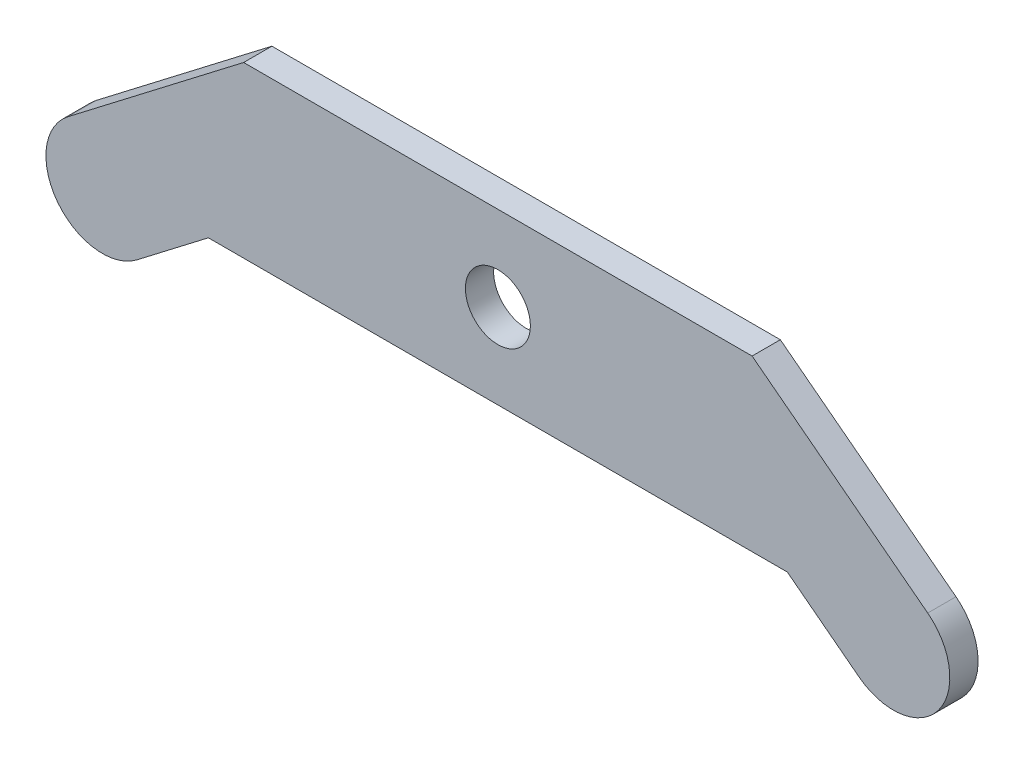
from build123d import *

# Parameters (mm, degrees)
SKETCH1_R           = 5.75
BOSS_EXTRUDE1_DEPTH = 2.5


with BuildPart() as part:
    # Sketch1 → Boss-Extrude1 (new, symmetric)
    with BuildSketch(Plane.XY):
        with BuildLine():
            Line((-45, 0), (45, 0))
            Line((45, 0), (76.08761429, -23.854365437))
            ThreePointArc((76.08761429, -23.854365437), (77.933533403, -37.87551313), (63.91238571, -39.721432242))
            Line((63.91238571, -39.721432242), (51.243168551, -30))
            Line((51.243168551, -30), (-51.243168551, -30))
            Line((-51.243168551, -30), (-63.91238571, -39.721432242))
            ThreePointArc((-63.91238571, -39.721432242), (-77.933533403, -37.87551313), (-76.08761429, -23.854365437))
            Line((-76.08761429, -23.854365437), (-45, 0))
        make_face()
        with Locations((0, -15)):
            Circle(SKETCH1_R, mode=Mode.SUBTRACT)
    extrude(amount=BOSS_EXTRUDE1_DEPTH, both=True)


solid = part.part
